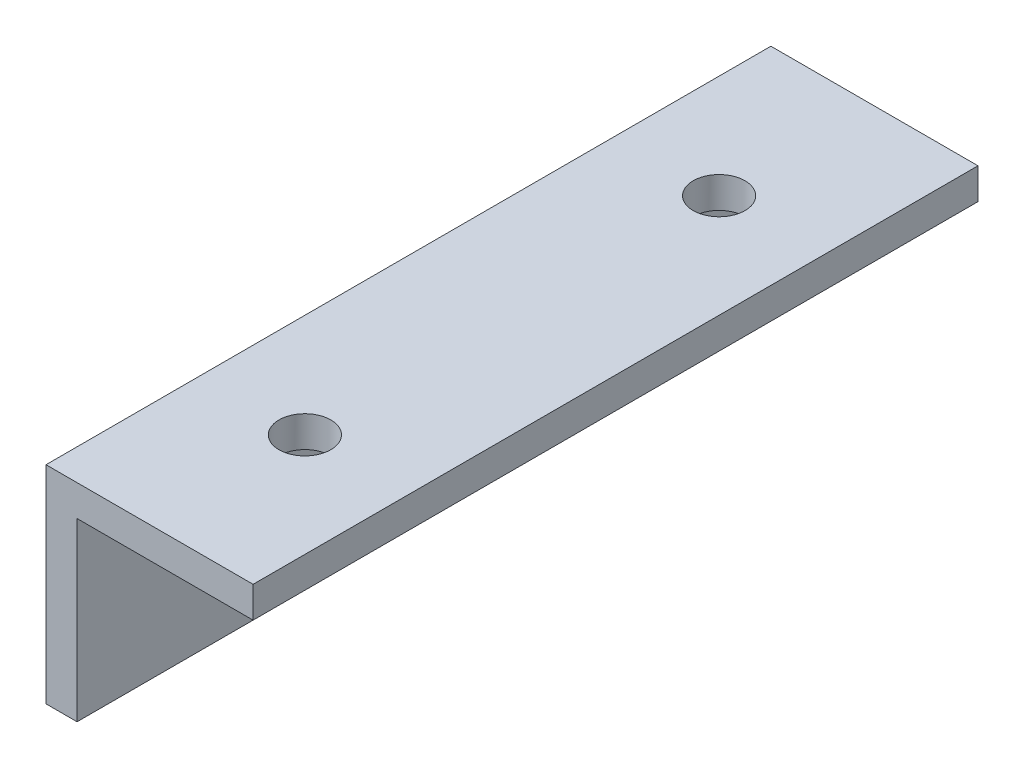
from build123d import *

# Parameters (mm, degrees)
EXTRUDE1_DEPTH    = 70
M6_TAPPED_HOLE1_D = 5


with BuildPart() as part:
    # Sketch1 → Extrude1 (new body)
    with BuildSketch(Plane.XY):
        Polygon((0, 0), (3, 0), (3, 17), (20, 17), (20, 20), (0, 20), align=None)
    extrude(amount=EXTRUDE1_DEPTH)

    # M6 Tapped Hole1 (through all)
    with Locations(Plane(origin=(10, 20, 15), x_dir=(0, 0, 1), z_dir=(0, 1, 0))):
        with Locations((0, 0), (40, 0)):
            Hole(M6_TAPPED_HOLE1_D / 2)


solid = part.part
